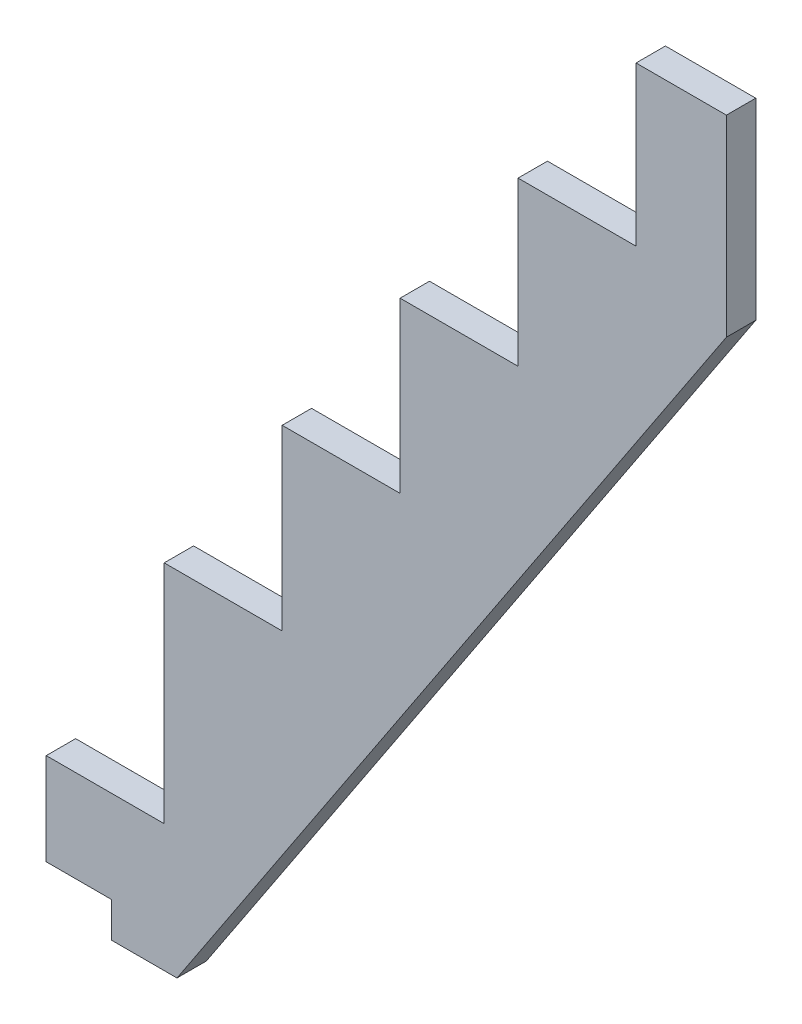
from build123d import *

# Parameters (mm, degrees)
EXTRUDE_1_DEPTH = 50


with BuildPart() as part:
    # Sketch 1 → Extrude 1 (new body)
    with BuildSketch(Plane.XY):
        Polygon((-724.412502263, -2519.972540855), (-613.412502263, -2519.972540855), (-613.412502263, -2579.972540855), (-501.907003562, -2579.972540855), (433.207497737, -1167.925726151), (433.207497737, -840.511783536), (279.437497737, -840.511783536), (279.437497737, -1110.579264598), (78.667497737, -1110.579264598), (78.667497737, -1387.993040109), (-122.102502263, -1387.993040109), (-122.102502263, -1675.731778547), (-322.872502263, -1675.731778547), (-322.872502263, -1978.89961371), (-523.642502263, -1978.89961371), (-523.642502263, -2363.393799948), (-724.412502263, -2363.393799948), align=None)
    extrude(amount=EXTRUDE_1_DEPTH)


solid = part.part
